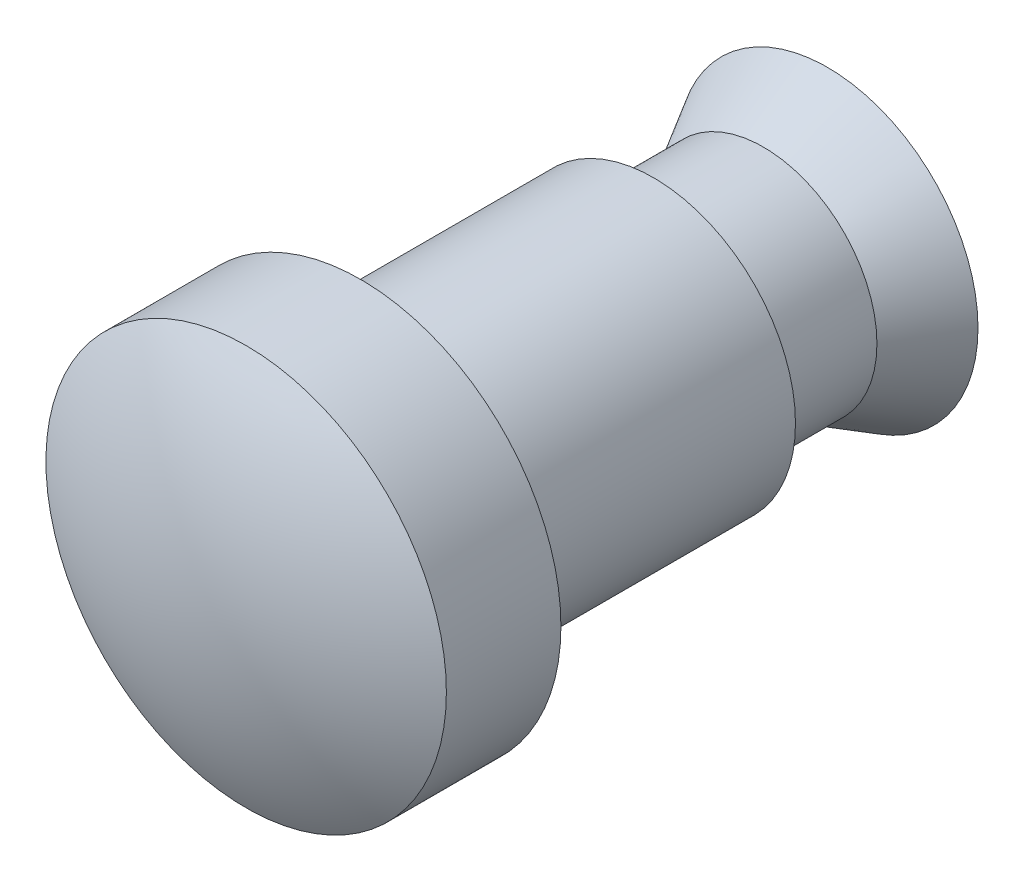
ISO-10303-21;
HEADER;
FILE_DESCRIPTION(('STEP AP214'),'2;1');
FILE_NAME('part.step','',(''),(''),'','','');
FILE_SCHEMA(('AUTOMOTIVE_DESIGN { 1 0 10303 214 1 1 1 1 }'));
ENDSEC;
DATA;
#1=APPLICATION_CONTEXT('core data for automotive mechanical design processes');
#2=APPLICATION_PROTOCOL_DEFINITION('international standard','automotive_design',2000,#1);
#3=PRODUCT_CONTEXT('',#1,'mechanical');
#4=PRODUCT('Part','Part','',(#3));
#5=PRODUCT_RELATED_PRODUCT_CATEGORY('part','',(#4));
#6=PRODUCT_DEFINITION_FORMATION('','',#4);
#7=PRODUCT_DEFINITION_CONTEXT('part definition',#1,'design');
#8=PRODUCT_DEFINITION('design','',#6,#7);
#9=PRODUCT_DEFINITION_SHAPE('','',#8);
#10=(LENGTH_UNIT() NAMED_UNIT(*) SI_UNIT(.MILLI.,.METRE.));
#11=(NAMED_UNIT(*) PLANE_ANGLE_UNIT() SI_UNIT($,.RADIAN.));
#12=(NAMED_UNIT(*) SI_UNIT($,.STERADIAN.) SOLID_ANGLE_UNIT());
#13=UNCERTAINTY_MEASURE_WITH_UNIT(LENGTH_MEASURE(1.E-05),#10,'distance_accuracy_value','');
#14=(GEOMETRIC_REPRESENTATION_CONTEXT(3) GLOBAL_UNCERTAINTY_ASSIGNED_CONTEXT((#13)) GLOBAL_UNIT_ASSIGNED_CONTEXT((#10,
#11,#12)) REPRESENTATION_CONTEXT('',''));
#15=CARTESIAN_POINT('',(0.,0.,0.));
#16=DIRECTION('',(0.,0.,1.));
#17=DIRECTION('',(1.,0.,0.));
#18=AXIS2_PLACEMENT_3D('',#15,#16,#17);
#19=CARTESIAN_POINT('',(0.,0.,-5.55625));
#20=DIRECTION('',(0.,0.,1.));
#21=DIRECTION('',(0.,1.,0.));
#22=AXIS2_PLACEMENT_3D('',#19,#20,#21);
#23=SPHERICAL_SURFACE('',#22,5.55625);
#24=CARTESIAN_POINT('',(0.,0.,-0.744396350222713));
#25=DIRECTION('',(0.,0.,1.));
#26=DIRECTION('',(1.,0.,0.));
#27=AXIS2_PLACEMENT_3D('',#24,#25,#26);
#28=CIRCLE('',#27,2.778125);
#29=CARTESIAN_POINT('',(2.778125,0.,-0.744396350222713));
#30=VERTEX_POINT('',#29);
#31=EDGE_CURVE('E10',#30,#30,#28,.T.);
#32=ORIENTED_EDGE('',*,*,#31,.T.);
#33=EDGE_LOOP('',(#32));
#34=FACE_BOUND('',#33,.T.);
#35=ADVANCED_FACE('F35',(#34),#23,.T.);
#36=CARTESIAN_POINT('',(0.,0.,0.));
#37=DIRECTION('',(0.,0.,1.));
#38=DIRECTION('',(1.,0.,0.));
#39=AXIS2_PLACEMENT_3D('',#36,#37,#38);
#40=CYLINDRICAL_SURFACE('',#39,2.778125);
#41=ORIENTED_EDGE('',*,*,#31,.F.);
#42=EDGE_LOOP('',(#41));
#43=FACE_BOUND('',#42,.T.);
#44=CARTESIAN_POINT('',(0.,0.,-2.333625));
#45=DIRECTION('',(0.,0.,1.));
#46=DIRECTION('',(1.,0.,0.));
#47=AXIS2_PLACEMENT_3D('',#44,#45,#46);
#48=CIRCLE('',#47,2.778125);
#49=CARTESIAN_POINT('',(2.778125,0.,-2.333625));
#50=VERTEX_POINT('',#49);
#51=EDGE_CURVE('E41',#50,#50,#48,.T.);
#52=ORIENTED_EDGE('',*,*,#51,.T.);
#53=EDGE_LOOP('',(#52));
#54=FACE_BOUND('',#53,.T.);
#55=ADVANCED_FACE('F76',(#43,#54),#40,.T.);
#56=CARTESIAN_POINT('',(0.,1.9685,-2.333625));
#57=DIRECTION('',(0.,0.,1.));
#58=DIRECTION('',(1.,0.,0.));
#59=AXIS2_PLACEMENT_3D('',#56,#57,#58);
#60=PLANE('',#59);
#61=ORIENTED_EDGE('',*,*,#51,.F.);
#62=EDGE_LOOP('',(#61));
#63=FACE_BOUND('',#62,.T.);
#64=CARTESIAN_POINT('',(0.,0.,-2.333625));
#65=DIRECTION('',(0.,0.,1.));
#66=DIRECTION('',(1.,0.,0.));
#67=AXIS2_PLACEMENT_3D('',#64,#65,#66);
#68=CIRCLE('',#67,1.9685);
#69=CARTESIAN_POINT('',(1.9685,0.,-2.333625));
#70=VERTEX_POINT('',#69);
#71=EDGE_CURVE('E45',#70,#70,#68,.T.);
#72=ORIENTED_EDGE('',*,*,#71,.T.);
#73=EDGE_LOOP('',(#72));
#74=FACE_BOUND('',#73,.T.);
#75=ADVANCED_FACE('F80',(#63,#74),#60,.F.);
#76=CARTESIAN_POINT('',(0.,0.,0.));
#77=DIRECTION('',(0.,0.,1.));
#78=DIRECTION('',(1.,0.,0.));
#79=AXIS2_PLACEMENT_3D('',#76,#77,#78);
#80=CYLINDRICAL_SURFACE('',#79,1.9685);
#81=ORIENTED_EDGE('',*,*,#71,.F.);
#82=EDGE_LOOP('',(#81));
#83=FACE_BOUND('',#82,.T.);
#84=CARTESIAN_POINT('',(0.,0.,-6.397625));
#85=DIRECTION('',(0.,0.,1.));
#86=DIRECTION('',(1.,0.,0.));
#87=AXIS2_PLACEMENT_3D('',#84,#85,#86);
#88=CIRCLE('',#87,1.9685);
#89=CARTESIAN_POINT('',(1.9685,0.,-6.397625));
#90=VERTEX_POINT('',#89);
#91=EDGE_CURVE('E49',#90,#90,#88,.T.);
#92=ORIENTED_EDGE('',*,*,#91,.T.);
#93=EDGE_LOOP('',(#92));
#94=FACE_BOUND('',#93,.T.);
#95=ADVANCED_FACE('F85',(#83,#94),#80,.T.);
#96=CARTESIAN_POINT('',(0.,1.5748,-6.397625));
#97=DIRECTION('',(0.,0.,1.));
#98=DIRECTION('',(1.,0.,0.));
#99=AXIS2_PLACEMENT_3D('',#96,#97,#98);
#100=PLANE('',#99);
#101=ORIENTED_EDGE('',*,*,#91,.F.);
#102=EDGE_LOOP('',(#101));
#103=FACE_BOUND('',#102,.T.);
#104=CARTESIAN_POINT('',(0.,0.,-6.397625));
#105=DIRECTION('',(0.,0.,1.));
#106=DIRECTION('',(1.,0.,0.));
#107=AXIS2_PLACEMENT_3D('',#104,#105,#106);
#108=CIRCLE('',#107,1.5748);
#109=CARTESIAN_POINT('',(1.5748,0.,-6.397625));
#110=VERTEX_POINT('',#109);
#111=EDGE_CURVE('E54',#110,#110,#108,.T.);
#112=ORIENTED_EDGE('',*,*,#111,.T.);
#113=EDGE_LOOP('',(#112));
#114=FACE_BOUND('',#113,.T.);
#115=ADVANCED_FACE('F91',(#103,#114),#100,.F.);
#116=CARTESIAN_POINT('',(0.,0.,0.));
#117=DIRECTION('',(0.,0.,1.));
#118=DIRECTION('',(1.,0.,0.));
#119=AXIS2_PLACEMENT_3D('',#116,#117,#118);
#120=CYLINDRICAL_SURFACE('',#119,1.5748);
#121=ORIENTED_EDGE('',*,*,#111,.F.);
#122=EDGE_LOOP('',(#121));
#123=FACE_BOUND('',#122,.T.);
#124=CARTESIAN_POINT('',(0.,0.,-7.92162499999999));
#125=DIRECTION('',(0.,0.,1.));
#126=DIRECTION('',(1.,0.,0.));
#127=AXIS2_PLACEMENT_3D('',#124,#125,#126);
#128=CIRCLE('',#127,1.5748);
#129=CARTESIAN_POINT('',(1.5748,0.,-7.92162499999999));
#130=VERTEX_POINT('',#129);
#131=EDGE_CURVE('E57',#130,#130,#128,.T.);
#132=ORIENTED_EDGE('',*,*,#131,.T.);
#133=EDGE_LOOP('',(#132));
#134=FACE_BOUND('',#133,.T.);
#135=ADVANCED_FACE('F72',(#123,#134),#120,.T.);
#136=CARTESIAN_POINT('',(0.,0.,-8.810625));
#137=DIRECTION('',(0.,0.,-1.));
#138=DIRECTION('',(-1.,0.,0.));
#139=AXIS2_PLACEMENT_3D('',#136,#137,#138);
#140=CONICAL_SURFACE('',#139,2.08806438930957,0.523598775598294);
#141=ORIENTED_EDGE('',*,*,#131,.F.);
#142=EDGE_LOOP('',(#141));
#143=FACE_BOUND('',#142,.T.);
#144=CARTESIAN_POINT('',(0.,0.,-8.810625));
#145=DIRECTION('',(0.,0.,1.));
#146=DIRECTION('',(1.,0.,0.));
#147=AXIS2_PLACEMENT_3D('',#144,#145,#146);
#148=CIRCLE('',#147,2.08806438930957);
#149=CARTESIAN_POINT('',(2.08806438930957,0.,-8.810625));
#150=VERTEX_POINT('',#149);
#151=EDGE_CURVE('E60',#150,#150,#148,.T.);
#152=ORIENTED_EDGE('',*,*,#151,.T.);
#153=EDGE_LOOP('',(#152));
#154=FACE_BOUND('',#153,.T.);
#155=ADVANCED_FACE('F64',(#143,#154),#140,.T.);
#156=CARTESIAN_POINT('',(0.,0.,-8.810625));
#157=DIRECTION('',(0.,0.,1.));
#158=DIRECTION('',(1.,0.,0.));
#159=AXIS2_PLACEMENT_3D('',#156,#157,#158);
#160=PLANE('',#159);
#161=ORIENTED_EDGE('',*,*,#151,.F.);
#162=EDGE_LOOP('',(#161));
#163=FACE_BOUND('',#162,.T.);
#164=ADVANCED_FACE('F66',(#163),#160,.F.);
#165=CLOSED_SHELL('',(#35,#55,#75,#95,#115,#135,#155,#164));
#166=MANIFOLD_SOLID_BREP('B2',#165);
#167=ADVANCED_BREP_SHAPE_REPRESENTATION('',(#18,#166),#14);
#168=SHAPE_DEFINITION_REPRESENTATION(#9,#167);
ENDSEC;
END-ISO-10303-21;
